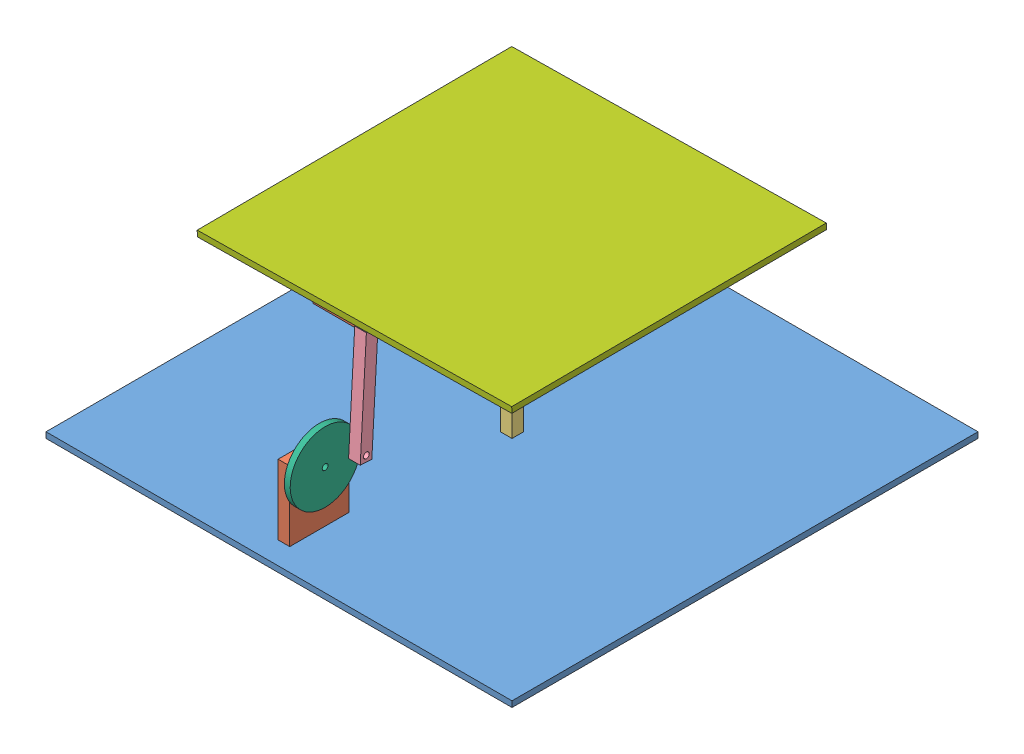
SolidWorks assembly Assem1.sldasm, configuration Default (file format 12000). Lengths in mm.
Overall size (400 160.15 400).
12 component instances, 8 part files, 24 mates.
Components (placement in the parent):
- Floor-1: Floor.SLDPRT [Default] at (-58.989 221.7118 500.9031) size (400 5 400)
- Base-1: Base.SLDPRT [Default] at (121.011 226.7118 481.7031) x (0 0 -1) z (1 0 0) size (50.8 60 10)
- Base-2: Base.SLDPRT [Default] at (-39.789 226.7118 280.9031) size (50.8 60 10)
- Support-1: Support.SLDPRT [Default] at (136.011 226.7118 305.9031) size (10 141 10)
- Lever Arm-1: Lever Arm.SLDPRT [Default] at (146.011 271.9343 436.1885) x (0 -0.055127 -0.998479) z (1 0 0) size (10 96 10)
- Lever Arm-2: Lever Arm.SLDPRT [Default] at (5.7432 270.8768 305.9031) x (0.998486 -0.055006 0) z (0 0 1) size (10 96 10)
- Joint-1: Joint.SLDPRT [Default] at (16.0163 366.4565 300.9031) x (0.18012 -0.002972 0.98364) z (-0.983544 -0.01482 0.180058) size (10 11 10)
- Joint-2: Joint.SLDPRT [Default] at (141.011 367.5127 425.9039) x (-0.908869 -0.015096 0.416808) z (-0.416844 -0.00077 -0.908978) size (10 11 10)
- Disk-1: Disk.SLDPRT [Default] at (131.011 275.7118 456.3031) x (0 0.036978 -0.999316) z (1 0 0) size (60 60 5)
- Disk-2: Disk.SLDPRT [Default] at (-14.389 275.7118 290.9031) x (0.999989 -0.004629 0) z (0 0 1) size (60 60 5)
- plate-1: plate.SLDPRT [Default] at (5.8704 376.5598 435.9623) x (-0.000056 0.005593 -0.999984) z (-0.999901 -0.014042 -0.000022) size (270 5 270)
- JointS-1: JointS.SLDPRT [Default] at (141.011 367.7118 300.9031) x (0.9999 0.01405 -0.001374) z (0.001453 -0.005573 0.999983) size (10 11.5 10)
Mates (geometry in assembly coordinates):
- Tangent3: tangent aligned: sphere of Lever Arm-1; sphere of Joint-2
- Tangent4: tangent aligned: sphere of Lever Arm-2; sphere of Joint-1
- Coincident1: coincident anti-aligned: plane of Floor-1 through (-58.989 226.7118 500.9031) normal (0 1 0); plane of Support-1 through (136.011 226.7118 305.9031) normal (0 -1 0)
- Distance1: distance = 195 mm aligned: plane of Support-1 through (136.011 367.7118 305.9031) normal (0 0 1); plane of Floor-1 through (-58.989 226.7118 500.9031) normal (0 0 1)
- Distance2: distance = 195 mm aligned: plane of Support-1 through (136.011 367.7118 305.9031) normal (-1 0 0); plane of Floor-1 through (-58.989 226.7118 500.9031) normal (-1 0 0)
- Coincident4: coincident anti-aligned: plane of Floor-1 through (-58.989 226.7118 500.9031) normal (0 1 0); plane of Base-2 through (-39.789 226.7118 290.9031) normal (0 -1 0)
- Distance3: distance = 5 mm anti-aligned: plane of Base-2 through (-39.789 226.7118 290.9031) normal (0 0 1); plane of Support-1 through (136.011 367.7118 295.9031) normal (0 0 -1)
- Distance4: distance = 125 mm anti-aligned: plane of Support-1 through (136.011 367.7118 305.9031) normal (-1 0 0); plane of Base-2 through (11.011 226.7118 290.9031) normal (1 0 0)
- Coincident7: coincident anti-aligned: plane of Floor-1 through (-58.989 226.7118 500.9031) normal (0 1 0); plane of Base-1 through (131.011 226.7118 481.7031) normal (0 -1 0)
- Distance8: distance = 125 mm anti-aligned: plane of Support-1 through (136.011 367.7118 305.9031) normal (0 0 1); plane of Base-1 through (131.011 226.7118 430.9031) normal (0 0 -1)
- Distance10: distance = 5 mm anti-aligned: plane of Base-1 through (131.011 226.7118 481.7031) normal (1 0 0); plane of Support-1 through (136.011 367.7118 305.9031) normal (-1 0 0)
- Concentric5: concentric aligned: cylinder of Base-2 through (-14.389 275.7118 290.9031) axis (0 0 -1) radius 2.5; cylinder of Disk-2 through (-14.389 275.7118 295.9031) axis (0 0 -1) radius 2.5
- Coincident14: coincident anti-aligned: plane of Base-2 through (-39.789 226.7118 290.9031) normal (0 0 1); plane of Disk-2 through (-14.389 275.7118 290.9031) normal (0 0 -1)
- Coincident15: coincident anti-aligned: plane of Base-1 through (131.011 226.7118 481.7031) normal (1 0 0); plane of Disk-1 through (131.011 275.7118 456.3031) normal (-1 0 0)
- Concentric6: concentric aligned: cylinder of Base-1 through (131.011 275.7118 456.3031) axis (-1 0 0) radius 2.5; cylinder of Disk-1 through (136.011 275.7118 456.3031) axis (-1 0 0) radius 2.5
- Concentric7: concentric anti-aligned: cylinder of Lever Arm-1 through (135.011 276.651 430.9205) axis (1 0 0) radius 2.5; cylinder of Disk-1 through (136.011 276.651 430.9205) axis (-1 0 0) radius 2.5
- Coincident16: coincident anti-aligned: plane of Lever Arm-1 through (136.011 367.7883 430.8963) normal (-1 0 0); plane of Disk-1 through (136.011 275.7118 456.3031) normal (1 0 0)
- Concentric8: concentric anti-aligned: cylinder of Lever Arm-2 through (11.0107 275.5942 294.9031) axis (0 0 1) radius 2.5; cylinder of Disk-2 through (11.0107 275.5942 295.9031) axis (0 0 -1) radius 2.5
- Coincident17: coincident anti-aligned: plane of Lever Arm-2 through (11.0238 366.7315 295.9031) normal (0 0 -1); plane of Disk-2 through (-14.389 275.7118 295.9031) normal (0 0 1)
- Coincident22: coincident aligned: circle of Joint-1; circle of plate-1
- Concentric10: concentric aligned: circle of Joint-2; circle of plate-1
- Coincident30: coincident aligned: circle of Joint-2; circle of plate-1
- Concentric11: concentric: sphere of Support-1; sphere of JointS-1
- Coincident31: coincident aligned: circle of plate-1; circle of JointS-1
